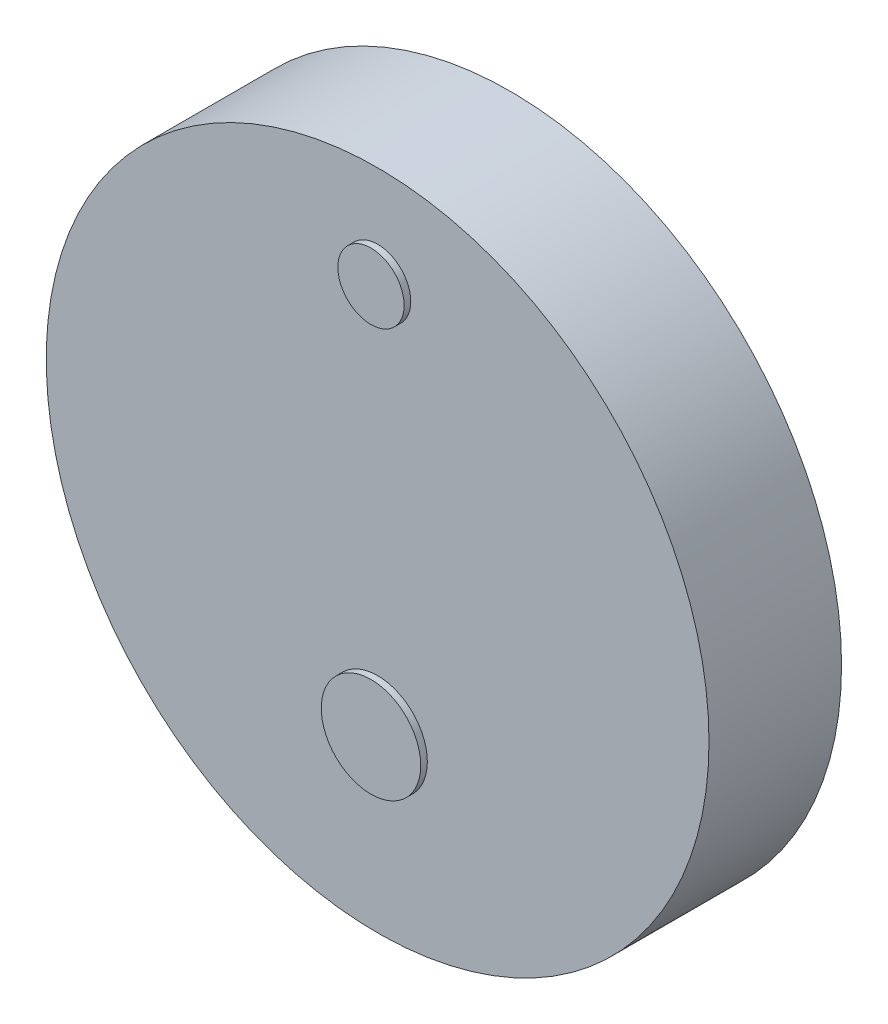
from build123d import *

# Parameters (mm, degrees)
CROQUIS1_R              = 50
SALIENTE_EXTRUIR1_DEPTH = 20
CROQUIS2_R              = 5
SALIENTE_EXTRUIR2_DEPTH = 1
CROQUIS3_R              = 7.5
SALIENTE_EXTRUIR3_DEPTH = 1


with BuildPart() as part:
    # Croquis1 → Saliente-Extruir1 (new body)
    with BuildSketch(Plane.XY):
        Circle(CROQUIS1_R)
    extrude(amount=SALIENTE_EXTRUIR1_DEPTH)

    # Croquis2 → Saliente-Extruir2 (add)
    with BuildSketch(Plane.XY.offset(20)):
        with Locations((0, 35)):
            Circle(CROQUIS2_R)
    extrude(amount=SALIENTE_EXTRUIR2_DEPTH)


with BuildPart() as body_2:
    # Croquis3 → Saliente-Extruir3 (new body)
    with BuildSketch(Plane.XY.offset(20)):
        with Locations((0, -23.871878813)):
            Circle(CROQUIS3_R)
    extrude(amount=SALIENTE_EXTRUIR3_DEPTH)


solid = Compound([part.part, body_2.part])
